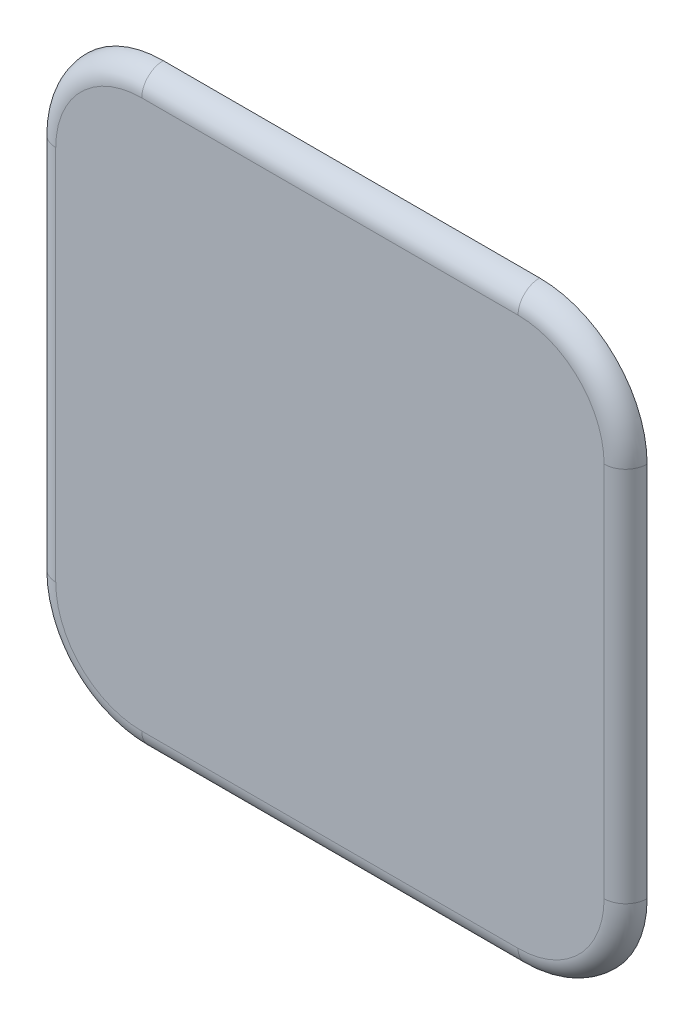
ISO-10303-21;
HEADER;
FILE_DESCRIPTION(('STEP AP214'),'2;1');
FILE_NAME('part.step','',(''),(''),'','','');
FILE_SCHEMA(('AUTOMOTIVE_DESIGN { 1 0 10303 214 1 1 1 1 }'));
ENDSEC;
DATA;
#1=APPLICATION_CONTEXT('core data for automotive mechanical design processes');
#2=APPLICATION_PROTOCOL_DEFINITION('international standard','automotive_design',2000,#1);
#3=PRODUCT_CONTEXT('',#1,'mechanical');
#4=PRODUCT('Part','Part','',(#3));
#5=PRODUCT_RELATED_PRODUCT_CATEGORY('part','',(#4));
#6=PRODUCT_DEFINITION_FORMATION('','',#4);
#7=PRODUCT_DEFINITION_CONTEXT('part definition',#1,'design');
#8=PRODUCT_DEFINITION('design','',#6,#7);
#9=PRODUCT_DEFINITION_SHAPE('','',#8);
#10=(LENGTH_UNIT() NAMED_UNIT(*) SI_UNIT(.MILLI.,.METRE.));
#11=(NAMED_UNIT(*) PLANE_ANGLE_UNIT() SI_UNIT($,.RADIAN.));
#12=(NAMED_UNIT(*) SI_UNIT($,.STERADIAN.) SOLID_ANGLE_UNIT());
#13=UNCERTAINTY_MEASURE_WITH_UNIT(LENGTH_MEASURE(1.E-05),#10,'distance_accuracy_value','');
#14=(GEOMETRIC_REPRESENTATION_CONTEXT(3) GLOBAL_UNCERTAINTY_ASSIGNED_CONTEXT((#13)) GLOBAL_UNIT_ASSIGNED_CONTEXT((#10,
#11,#12)) REPRESENTATION_CONTEXT('',''));
#15=CARTESIAN_POINT('',(0.,0.,0.));
#16=DIRECTION('',(0.,0.,1.));
#17=DIRECTION('',(1.,0.,0.));
#18=AXIS2_PLACEMENT_3D('',#15,#16,#17);
#19=CARTESIAN_POINT('',(-8.75,-8.75,1.));
#20=DIRECTION('',(0.,0.,-1.));
#21=DIRECTION('',(-1.,0.,0.));
#22=AXIS2_PLACEMENT_3D('',#19,#20,#21);
#23=PLANE('',#22);
#24=CARTESIAN_POINT('',(-8.75,8.74999999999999,1.));
#25=DIRECTION('',(0.,0.,-1.));
#26=DIRECTION('',(-1.,0.,0.));
#27=AXIS2_PLACEMENT_3D('',#24,#25,#26);
#28=CIRCLE('',#27,4.);
#29=CARTESIAN_POINT('',(-8.75,12.75,1.));
#30=VERTEX_POINT('',#29);
#31=CARTESIAN_POINT('',(-12.75,8.74999999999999,1.));
#32=VERTEX_POINT('',#31);
#33=EDGE_CURVE('E41',#30,#32,#28,.F.);
#34=ORIENTED_EDGE('',*,*,#33,.T.);
#35=DIRECTION('',(0.,-1.,0.));
#36=VECTOR('',#35,1.);
#37=CARTESIAN_POINT('',(-12.75,-8.75,1.));
#38=LINE('',#37,#36);
#39=CARTESIAN_POINT('',(-12.75,-8.75,1.));
#40=VERTEX_POINT('',#39);
#41=EDGE_CURVE('E11',#32,#40,#38,.T.);
#42=ORIENTED_EDGE('',*,*,#41,.T.);
#43=CARTESIAN_POINT('',(-8.75,-8.75,1.));
#44=DIRECTION('',(0.,0.,-1.));
#45=DIRECTION('',(-1.,0.,0.));
#46=AXIS2_PLACEMENT_3D('',#43,#44,#45);
#47=CIRCLE('',#46,4.);
#48=CARTESIAN_POINT('',(-8.75,-12.75,1.));
#49=VERTEX_POINT('',#48);
#50=EDGE_CURVE('E141',#40,#49,#47,.F.);
#51=ORIENTED_EDGE('',*,*,#50,.T.);
#52=DIRECTION('',(1.,0.,0.));
#53=VECTOR('',#52,1.);
#54=CARTESIAN_POINT('',(-8.75,-12.75,1.));
#55=LINE('',#54,#53);
#56=CARTESIAN_POINT('',(8.75,-12.75,1.));
#57=VERTEX_POINT('',#56);
#58=EDGE_CURVE('E113',#49,#57,#55,.T.);
#59=ORIENTED_EDGE('',*,*,#58,.T.);
#60=CARTESIAN_POINT('',(8.75,-8.75,1.));
#61=DIRECTION('',(0.,0.,-1.));
#62=DIRECTION('',(-1.,0.,0.));
#63=AXIS2_PLACEMENT_3D('',#60,#61,#62);
#64=CIRCLE('',#63,4.);
#65=CARTESIAN_POINT('',(12.75,-8.75,1.));
#66=VERTEX_POINT('',#65);
#67=EDGE_CURVE('E144',#57,#66,#64,.F.);
#68=ORIENTED_EDGE('',*,*,#67,.T.);
#69=DIRECTION('',(0.,1.,0.));
#70=VECTOR('',#69,1.);
#71=CARTESIAN_POINT('',(12.75,-8.75000000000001,1.));
#72=LINE('',#71,#70);
#73=CARTESIAN_POINT('',(12.75,8.75,1.));
#74=VERTEX_POINT('',#73);
#75=EDGE_CURVE('E146',#66,#74,#72,.T.);
#76=ORIENTED_EDGE('',*,*,#75,.T.);
#77=CARTESIAN_POINT('',(8.75,8.75,1.));
#78=DIRECTION('',(0.,0.,-1.));
#79=DIRECTION('',(-1.,0.,0.));
#80=AXIS2_PLACEMENT_3D('',#77,#78,#79);
#81=CIRCLE('',#80,4.);
#82=CARTESIAN_POINT('',(8.75,12.75,1.));
#83=VERTEX_POINT('',#82);
#84=EDGE_CURVE('E148',#74,#83,#81,.F.);
#85=ORIENTED_EDGE('',*,*,#84,.T.);
#86=DIRECTION('',(-1.,0.,0.));
#87=VECTOR('',#86,1.);
#88=CARTESIAN_POINT('',(-8.75000000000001,12.75,1.));
#89=LINE('',#88,#87);
#90=EDGE_CURVE('E52',#83,#30,#89,.T.);
#91=ORIENTED_EDGE('',*,*,#90,.T.);
#92=EDGE_LOOP('',(#34,#42,#51,#59,#68,#76,#85,#91));
#93=FACE_BOUND('',#92,.T.);
#94=ADVANCED_FACE('F32',(#93),#23,.F.);
#95=CARTESIAN_POINT('',(-8.75,-8.75,0.));
#96=DIRECTION('',(0.,0.,-1.));
#97=DIRECTION('',(-1.,0.,0.));
#98=AXIS2_PLACEMENT_3D('',#95,#96,#97);
#99=PLANE('',#98);
#100=CARTESIAN_POINT('',(-8.75,-8.75,0.));
#101=DIRECTION('',(0.,0.,1.));
#102=DIRECTION('',(-1.,0.,0.));
#103=AXIS2_PLACEMENT_3D('',#100,#101,#102);
#104=CIRCLE('',#103,5.);
#105=CARTESIAN_POINT('',(-13.75,-8.75,0.));
#106=VERTEX_POINT('',#105);
#107=CARTESIAN_POINT('',(-8.75,-13.75,0.));
#108=VERTEX_POINT('',#107);
#109=EDGE_CURVE('E101',#106,#108,#104,.T.);
#110=ORIENTED_EDGE('',*,*,#109,.F.);
#111=DIRECTION('',(0.,-1.,0.));
#112=VECTOR('',#111,1.);
#113=CARTESIAN_POINT('',(-13.75,-8.75,0.));
#114=LINE('',#113,#112);
#115=CARTESIAN_POINT('',(-13.75,8.74999999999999,0.));
#116=VERTEX_POINT('',#115);
#117=EDGE_CURVE('E139',#116,#106,#114,.T.);
#118=ORIENTED_EDGE('',*,*,#117,.F.);
#119=CARTESIAN_POINT('',(-8.75,8.74999999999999,0.));
#120=DIRECTION('',(0.,0.,1.));
#121=DIRECTION('',(1.,0.,0.));
#122=AXIS2_PLACEMENT_3D('',#119,#120,#121);
#123=CIRCLE('',#122,5.);
#124=CARTESIAN_POINT('',(-8.75,13.75,0.));
#125=VERTEX_POINT('',#124);
#126=EDGE_CURVE('E136',#125,#116,#123,.T.);
#127=ORIENTED_EDGE('',*,*,#126,.F.);
#128=DIRECTION('',(-1.,0.,0.));
#129=VECTOR('',#128,1.);
#130=CARTESIAN_POINT('',(8.75,13.75,0.));
#131=LINE('',#130,#129);
#132=CARTESIAN_POINT('',(8.75,13.75,0.));
#133=VERTEX_POINT('',#132);
#134=EDGE_CURVE('E133',#133,#125,#131,.T.);
#135=ORIENTED_EDGE('',*,*,#134,.F.);
#136=CARTESIAN_POINT('',(8.75,8.75,0.));
#137=DIRECTION('',(0.,0.,1.));
#138=DIRECTION('',(1.,0.,0.));
#139=AXIS2_PLACEMENT_3D('',#136,#137,#138);
#140=CIRCLE('',#139,5.);
#141=CARTESIAN_POINT('',(13.75,8.75,0.));
#142=VERTEX_POINT('',#141);
#143=EDGE_CURVE('E130',#142,#133,#140,.T.);
#144=ORIENTED_EDGE('',*,*,#143,.F.);
#145=DIRECTION('',(0.,1.,0.));
#146=VECTOR('',#145,1.);
#147=CARTESIAN_POINT('',(13.75,-8.75,0.));
#148=LINE('',#147,#146);
#149=CARTESIAN_POINT('',(13.75,-8.75,0.));
#150=VERTEX_POINT('',#149);
#151=EDGE_CURVE('E127',#150,#142,#148,.T.);
#152=ORIENTED_EDGE('',*,*,#151,.F.);
#153=CARTESIAN_POINT('',(8.75,-8.75,0.));
#154=DIRECTION('',(0.,0.,1.));
#155=DIRECTION('',(1.,0.,0.));
#156=AXIS2_PLACEMENT_3D('',#153,#154,#155);
#157=CIRCLE('',#156,5.);
#158=CARTESIAN_POINT('',(8.75,-13.75,0.));
#159=VERTEX_POINT('',#158);
#160=EDGE_CURVE('E104',#159,#150,#157,.T.);
#161=ORIENTED_EDGE('',*,*,#160,.F.);
#162=DIRECTION('',(1.,0.,0.));
#163=VECTOR('',#162,1.);
#164=CARTESIAN_POINT('',(8.75,-13.75,0.));
#165=LINE('',#164,#163);
#166=EDGE_CURVE('E96',#108,#159,#165,.T.);
#167=ORIENTED_EDGE('',*,*,#166,.F.);
#168=EDGE_LOOP('',(#110,#118,#127,#135,#144,#152,#161,#167));
#169=FACE_BOUND('',#168,.T.);
#170=ADVANCED_FACE('F98',(#169),#99,.T.);
#171=CARTESIAN_POINT('',(12.75,-8.75000000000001,0.));
#172=DIRECTION('',(0.,1.,0.));
#173=DIRECTION('',(-1.,0.,0.));
#174=AXIS2_PLACEMENT_3D('',#171,#172,#173);
#175=CYLINDRICAL_SURFACE('',#174,1.);
#176=CARTESIAN_POINT('',(12.75,-8.75,0.));
#177=DIRECTION('',(0.,-1.,0.));
#178=DIRECTION('',(0.,0.,-1.));
#179=AXIS2_PLACEMENT_3D('',#176,#177,#178);
#180=CIRCLE('',#179,1.);
#181=EDGE_CURVE('E124',#150,#66,#180,.T.);
#182=ORIENTED_EDGE('',*,*,#181,.F.);
#183=ORIENTED_EDGE('',*,*,#151,.T.);
#184=CARTESIAN_POINT('',(12.75,8.75,0.));
#185=DIRECTION('',(0.,1.,0.));
#186=DIRECTION('',(0.,0.,1.));
#187=AXIS2_PLACEMENT_3D('',#184,#185,#186);
#188=CIRCLE('',#187,1.);
#189=EDGE_CURVE('E36',#74,#142,#188,.T.);
#190=ORIENTED_EDGE('',*,*,#189,.F.);
#191=ORIENTED_EDGE('',*,*,#75,.F.);
#192=EDGE_LOOP('',(#182,#183,#190,#191));
#193=FACE_BOUND('',#192,.T.);
#194=ADVANCED_FACE('F34',(#193),#175,.T.);
#195=CARTESIAN_POINT('',(8.75,8.75,0.));
#196=DIRECTION('',(0.,0.,-1.));
#197=DIRECTION('',(-1.,0.,0.));
#198=AXIS2_PLACEMENT_3D('',#195,#196,#197);
#199=TOROIDAL_SURFACE('',#198,4.,1.);
#200=ORIENTED_EDGE('',*,*,#189,.T.);
#201=ORIENTED_EDGE('',*,*,#143,.T.);
#202=CARTESIAN_POINT('',(8.75,12.75,0.));
#203=DIRECTION('',(-1.,0.,0.));
#204=DIRECTION('',(0.,0.,1.));
#205=AXIS2_PLACEMENT_3D('',#202,#203,#204);
#206=CIRCLE('',#205,1.);
#207=EDGE_CURVE('E158',#83,#133,#206,.T.);
#208=ORIENTED_EDGE('',*,*,#207,.F.);
#209=ORIENTED_EDGE('',*,*,#84,.F.);
#210=EDGE_LOOP('',(#200,#201,#208,#209));
#211=FACE_BOUND('',#210,.T.);
#212=ADVANCED_FACE('F226',(#211),#199,.T.);
#213=CARTESIAN_POINT('',(8.75,-8.75,0.));
#214=DIRECTION('',(0.,0.,-1.));
#215=DIRECTION('',(-1.,0.,0.));
#216=AXIS2_PLACEMENT_3D('',#213,#214,#215);
#217=TOROIDAL_SURFACE('',#216,4.,1.);
#218=ORIENTED_EDGE('',*,*,#181,.T.);
#219=ORIENTED_EDGE('',*,*,#67,.F.);
#220=CARTESIAN_POINT('',(8.75,-12.75,0.));
#221=DIRECTION('',(-1.,0.,0.));
#222=DIRECTION('',(0.,0.,1.));
#223=AXIS2_PLACEMENT_3D('',#220,#221,#222);
#224=CIRCLE('',#223,1.);
#225=EDGE_CURVE('E156',#159,#57,#224,.T.);
#226=ORIENTED_EDGE('',*,*,#225,.F.);
#227=ORIENTED_EDGE('',*,*,#160,.T.);
#228=EDGE_LOOP('',(#218,#219,#226,#227));
#229=FACE_BOUND('',#228,.T.);
#230=ADVANCED_FACE('F164',(#229),#217,.T.);
#231=CARTESIAN_POINT('',(-8.75000000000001,12.75,0.));
#232=DIRECTION('',(-1.,0.,0.));
#233=DIRECTION('',(0.,-1.,0.));
#234=AXIS2_PLACEMENT_3D('',#231,#232,#233);
#235=CYLINDRICAL_SURFACE('',#234,1.);
#236=ORIENTED_EDGE('',*,*,#207,.T.);
#237=ORIENTED_EDGE('',*,*,#134,.T.);
#238=CARTESIAN_POINT('',(-8.75,12.75,0.));
#239=DIRECTION('',(-1.,0.,0.));
#240=DIRECTION('',(0.,0.,1.));
#241=AXIS2_PLACEMENT_3D('',#238,#239,#240);
#242=CIRCLE('',#241,1.);
#243=EDGE_CURVE('E116',#30,#125,#242,.T.);
#244=ORIENTED_EDGE('',*,*,#243,.F.);
#245=ORIENTED_EDGE('',*,*,#90,.F.);
#246=EDGE_LOOP('',(#236,#237,#244,#245));
#247=FACE_BOUND('',#246,.T.);
#248=ADVANCED_FACE('F175',(#247),#235,.T.);
#249=CARTESIAN_POINT('',(-8.75,-12.75,0.));
#250=DIRECTION('',(1.,0.,0.));
#251=DIRECTION('',(0.,1.,0.));
#252=AXIS2_PLACEMENT_3D('',#249,#250,#251);
#253=CYLINDRICAL_SURFACE('',#252,1.);
#254=ORIENTED_EDGE('',*,*,#225,.T.);
#255=ORIENTED_EDGE('',*,*,#58,.F.);
#256=CARTESIAN_POINT('',(-8.75,-12.75,0.));
#257=DIRECTION('',(-1.,0.,0.));
#258=DIRECTION('',(0.,0.,1.));
#259=AXIS2_PLACEMENT_3D('',#256,#257,#258);
#260=CIRCLE('',#259,1.);
#261=EDGE_CURVE('E111',#108,#49,#260,.T.);
#262=ORIENTED_EDGE('',*,*,#261,.F.);
#263=ORIENTED_EDGE('',*,*,#166,.T.);
#264=EDGE_LOOP('',(#254,#255,#262,#263));
#265=FACE_BOUND('',#264,.T.);
#266=ADVANCED_FACE('F112',(#265),#253,.T.);
#267=CARTESIAN_POINT('',(-8.75,8.74999999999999,0.));
#268=DIRECTION('',(0.,0.,-1.));
#269=DIRECTION('',(-1.,0.,0.));
#270=AXIS2_PLACEMENT_3D('',#267,#268,#269);
#271=TOROIDAL_SURFACE('',#270,4.,1.);
#272=ORIENTED_EDGE('',*,*,#243,.T.);
#273=ORIENTED_EDGE('',*,*,#126,.T.);
#274=CARTESIAN_POINT('',(-12.75,8.74999999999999,0.));
#275=DIRECTION('',(0.,-1.,0.));
#276=DIRECTION('',(0.,0.,-1.));
#277=AXIS2_PLACEMENT_3D('',#274,#275,#276);
#278=CIRCLE('',#277,1.);
#279=EDGE_CURVE('E117',#32,#116,#278,.T.);
#280=ORIENTED_EDGE('',*,*,#279,.F.);
#281=ORIENTED_EDGE('',*,*,#33,.F.);
#282=EDGE_LOOP('',(#272,#273,#280,#281));
#283=FACE_BOUND('',#282,.T.);
#284=ADVANCED_FACE('F176',(#283),#271,.T.);
#285=CARTESIAN_POINT('',(-8.75,-8.75,0.));
#286=DIRECTION('',(0.,0.,-1.));
#287=DIRECTION('',(-1.,0.,0.));
#288=AXIS2_PLACEMENT_3D('',#285,#286,#287);
#289=TOROIDAL_SURFACE('',#288,4.,1.);
#290=ORIENTED_EDGE('',*,*,#261,.T.);
#291=ORIENTED_EDGE('',*,*,#50,.F.);
#292=CARTESIAN_POINT('',(-12.75,-8.75,0.));
#293=DIRECTION('',(0.,1.,0.));
#294=DIRECTION('',(0.,0.,1.));
#295=AXIS2_PLACEMENT_3D('',#292,#293,#294);
#296=CIRCLE('',#295,1.);
#297=EDGE_CURVE('E121',#106,#40,#296,.T.);
#298=ORIENTED_EDGE('',*,*,#297,.F.);
#299=ORIENTED_EDGE('',*,*,#109,.T.);
#300=EDGE_LOOP('',(#290,#291,#298,#299));
#301=FACE_BOUND('',#300,.T.);
#302=ADVANCED_FACE('F120',(#301),#289,.T.);
#303=CARTESIAN_POINT('',(-12.75,-8.75,0.));
#304=DIRECTION('',(0.,-1.,0.));
#305=DIRECTION('',(0.,0.,-1.));
#306=AXIS2_PLACEMENT_3D('',#303,#304,#305);
#307=CYLINDRICAL_SURFACE('',#306,1.);
#308=ORIENTED_EDGE('',*,*,#279,.T.);
#309=ORIENTED_EDGE('',*,*,#117,.T.);
#310=ORIENTED_EDGE('',*,*,#297,.T.);
#311=ORIENTED_EDGE('',*,*,#41,.F.);
#312=EDGE_LOOP('',(#308,#309,#310,#311));
#313=FACE_BOUND('',#312,.T.);
#314=ADVANCED_FACE('F172',(#313),#307,.T.);
#315=CLOSED_SHELL('',(#94,#170,#194,#212,#230,#248,#266,#284,#302,#314));
#316=MANIFOLD_SOLID_BREP('B2',#315);
#317=ADVANCED_BREP_SHAPE_REPRESENTATION('',(#18,#316),#14);
#318=SHAPE_DEFINITION_REPRESENTATION(#9,#317);
ENDSEC;
END-ISO-10303-21;
